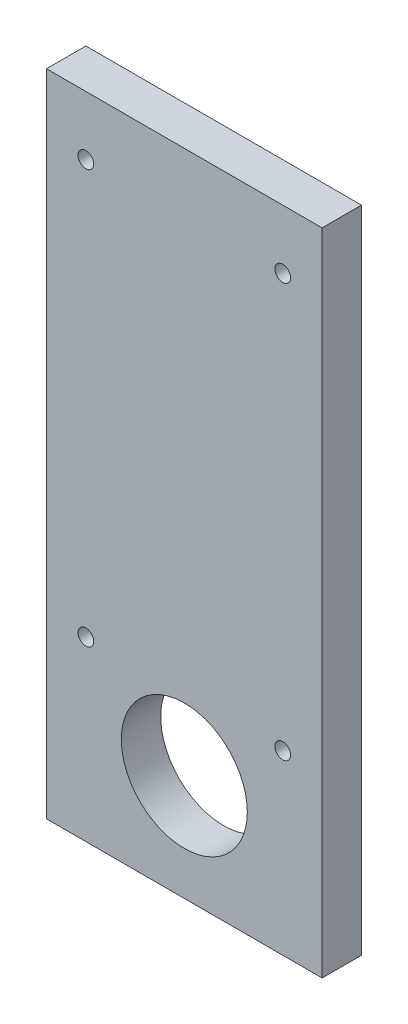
from build123d import *

# Parameters (mm, degrees)
CROQUIS1_W                    = 70
CROQUIS1_H                    = 165
CROQUIS1_R                    = 16
CROQUIS1_R_2                  = 2
EXTRUIR1_DEPTH                = 10
TALADRO_ROSCADO_DE_M4_1_D     = 3.3
TALADRO_ROSCADO_DE_M4_1_DEPTH = 15
TALADRO_ROSCADO_DE_M4_1_TIP   = 0.991420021


with BuildPart() as part:
    # Croquis1 → Extruir1 (new body)
    with BuildSketch(Plane.XY):
        with Locations((0, 55.5)):
            Rectangle(CROQUIS1_W, CROQUIS1_H)
        Circle(CROQUIS1_R, mode=Mode.SUBTRACT)
        with Locations((-25, 123)):
            Circle(CROQUIS1_R_2, mode=Mode.SUBTRACT)
        with Locations((25, 123)):
            Circle(CROQUIS1_R_2, mode=Mode.SUBTRACT)
        with Locations((25, 18)):
            Circle(CROQUIS1_R_2, mode=Mode.SUBTRACT)
        with Locations((-25, 18)):
            Circle(CROQUIS1_R_2, mode=Mode.SUBTRACT)
    extrude(amount=EXTRUIR1_DEPTH)

    # Taladro roscado de M4-1
    with Locations(Plane(origin=(-25, -27, 5), x_dir=(0, 0, -1), z_dir=(0, -1, 0))):
        with Locations((0, 0), (0, 50)):
            Hole(TALADRO_ROSCADO_DE_M4_1_D / 2, depth=TALADRO_ROSCADO_DE_M4_1_DEPTH)
            with Locations((0, 0, -(TALADRO_ROSCADO_DE_M4_1_DEPTH + TALADRO_ROSCADO_DE_M4_1_TIP / 2))):  # 118° drill point
                Cone(0, TALADRO_ROSCADO_DE_M4_1_D / 2, TALADRO_ROSCADO_DE_M4_1_TIP, mode=Mode.SUBTRACT)


solid = part.part
